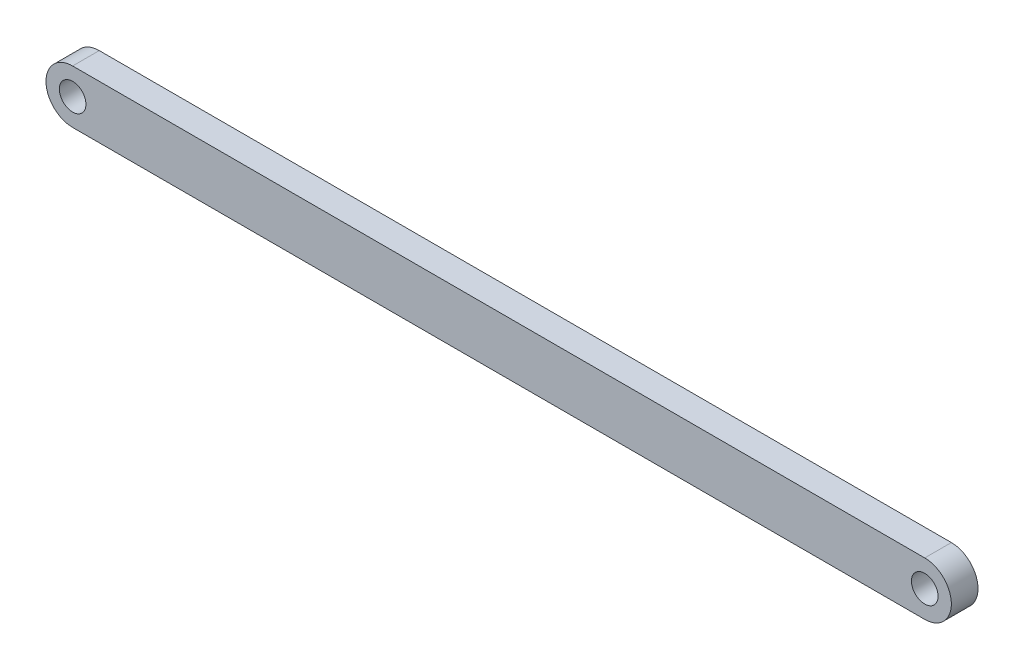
ISO-10303-21;
HEADER;
FILE_DESCRIPTION(('STEP AP214'),'2;1');
FILE_NAME('part.step','',(''),(''),'','','');
FILE_SCHEMA(('AUTOMOTIVE_DESIGN { 1 0 10303 214 1 1 1 1 }'));
ENDSEC;
DATA;
#1=APPLICATION_CONTEXT('core data for automotive mechanical design processes');
#2=APPLICATION_PROTOCOL_DEFINITION('international standard','automotive_design',2000,#1);
#3=PRODUCT_CONTEXT('',#1,'mechanical');
#4=PRODUCT('Part','Part','',(#3));
#5=PRODUCT_RELATED_PRODUCT_CATEGORY('part','',(#4));
#6=PRODUCT_DEFINITION_FORMATION('','',#4);
#7=PRODUCT_DEFINITION_CONTEXT('part definition',#1,'design');
#8=PRODUCT_DEFINITION('design','',#6,#7);
#9=PRODUCT_DEFINITION_SHAPE('','',#8);
#10=(LENGTH_UNIT() NAMED_UNIT(*) SI_UNIT(.MILLI.,.METRE.));
#11=(NAMED_UNIT(*) PLANE_ANGLE_UNIT() SI_UNIT($,.RADIAN.));
#12=(NAMED_UNIT(*) SI_UNIT($,.STERADIAN.) SOLID_ANGLE_UNIT());
#13=UNCERTAINTY_MEASURE_WITH_UNIT(LENGTH_MEASURE(1.E-05),#10,'distance_accuracy_value','');
#14=(GEOMETRIC_REPRESENTATION_CONTEXT(3) GLOBAL_UNCERTAINTY_ASSIGNED_CONTEXT((#13)) GLOBAL_UNIT_ASSIGNED_CONTEXT((#10,
#11,#12)) REPRESENTATION_CONTEXT('',''));
#15=CARTESIAN_POINT('',(0.,0.,0.));
#16=DIRECTION('',(0.,0.,1.));
#17=DIRECTION('',(1.,0.,0.));
#18=AXIS2_PLACEMENT_3D('',#15,#16,#17);
#19=CARTESIAN_POINT('',(0.,0.,3.175));
#20=DIRECTION('',(0.,0.,1.));
#21=DIRECTION('',(1.,0.,0.));
#22=AXIS2_PLACEMENT_3D('',#19,#20,#21);
#23=PLANE('',#22);
#24=CARTESIAN_POINT('',(0.,0.,3.175));
#25=DIRECTION('',(0.,0.,1.));
#26=DIRECTION('',(1.,0.,0.));
#27=AXIS2_PLACEMENT_3D('',#24,#25,#26);
#28=CIRCLE('',#27,1.5875);
#29=CARTESIAN_POINT('',(1.5875,0.,3.175));
#30=VERTEX_POINT('',#29);
#31=EDGE_CURVE('E100',#30,#30,#28,.T.);
#32=ORIENTED_EDGE('',*,*,#31,.F.);
#33=EDGE_LOOP('',(#32));
#34=FACE_BOUND('',#33,.T.);
#35=CARTESIAN_POINT('',(0.,0.,3.175));
#36=DIRECTION('',(0.,0.,1.));
#37=DIRECTION('',(1.,0.,0.));
#38=AXIS2_PLACEMENT_3D('',#35,#36,#37);
#39=CIRCLE('',#38,3.175);
#40=CARTESIAN_POINT('',(0.,3.175,3.175));
#41=VERTEX_POINT('',#40);
#42=CARTESIAN_POINT('',(0.,-3.175,3.175));
#43=VERTEX_POINT('',#42);
#44=EDGE_CURVE('E85',#41,#43,#39,.T.);
#45=ORIENTED_EDGE('',*,*,#44,.T.);
#46=DIRECTION('',(1.,0.,0.));
#47=VECTOR('',#46,1.);
#48=CARTESIAN_POINT('',(0.,-3.175,3.175));
#49=LINE('',#48,#47);
#50=CARTESIAN_POINT('',(101.6,-3.175,3.175));
#51=VERTEX_POINT('',#50);
#52=EDGE_CURVE('E80',#43,#51,#49,.T.);
#53=ORIENTED_EDGE('',*,*,#52,.T.);
#54=CARTESIAN_POINT('',(101.6,0.,3.175));
#55=DIRECTION('',(0.,0.,1.));
#56=DIRECTION('',(1.,0.,0.));
#57=AXIS2_PLACEMENT_3D('',#54,#55,#56);
#58=CIRCLE('',#57,3.175);
#59=CARTESIAN_POINT('',(101.6,3.175,3.175));
#60=VERTEX_POINT('',#59);
#61=EDGE_CURVE('E83',#51,#60,#58,.T.);
#62=ORIENTED_EDGE('',*,*,#61,.T.);
#63=DIRECTION('',(-1.,0.,0.));
#64=VECTOR('',#63,1.);
#65=CARTESIAN_POINT('',(0.,3.175,3.175));
#66=LINE('',#65,#64);
#67=EDGE_CURVE('E50',#60,#41,#66,.T.);
#68=ORIENTED_EDGE('',*,*,#67,.T.);
#69=EDGE_LOOP('',(#45,#53,#62,#68));
#70=FACE_BOUND('',#69,.T.);
#71=CARTESIAN_POINT('',(101.6,0.,3.175));
#72=DIRECTION('',(0.,0.,1.));
#73=DIRECTION('',(1.,0.,0.));
#74=AXIS2_PLACEMENT_3D('',#71,#72,#73);
#75=CIRCLE('',#74,1.58749999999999);
#76=CARTESIAN_POINT('',(103.1875,0.,3.175));
#77=VERTEX_POINT('',#76);
#78=EDGE_CURVE('E115',#77,#77,#75,.T.);
#79=ORIENTED_EDGE('',*,*,#78,.F.);
#80=EDGE_LOOP('',(#79));
#81=FACE_BOUND('',#80,.T.);
#82=ADVANCED_FACE('F33',(#34,#70,#81),#23,.T.);
#83=CARTESIAN_POINT('',(0.,0.,0.));
#84=DIRECTION('',(0.,0.,1.));
#85=DIRECTION('',(1.,0.,0.));
#86=AXIS2_PLACEMENT_3D('',#83,#84,#85);
#87=PLANE('',#86);
#88=CARTESIAN_POINT('',(0.,0.,0.));
#89=DIRECTION('',(0.,0.,1.));
#90=DIRECTION('',(1.,0.,0.));
#91=AXIS2_PLACEMENT_3D('',#88,#89,#90);
#92=CIRCLE('',#91,3.175);
#93=CARTESIAN_POINT('',(0.,3.175,0.));
#94=VERTEX_POINT('',#93);
#95=CARTESIAN_POINT('',(0.,-3.175,0.));
#96=VERTEX_POINT('',#95);
#97=EDGE_CURVE('E97',#94,#96,#92,.T.);
#98=ORIENTED_EDGE('',*,*,#97,.F.);
#99=DIRECTION('',(-1.,0.,0.));
#100=VECTOR('',#99,1.);
#101=CARTESIAN_POINT('',(0.,3.175,0.));
#102=LINE('',#101,#100);
#103=CARTESIAN_POINT('',(101.6,3.175,0.));
#104=VERTEX_POINT('',#103);
#105=EDGE_CURVE('E73',#104,#94,#102,.T.);
#106=ORIENTED_EDGE('',*,*,#105,.F.);
#107=CARTESIAN_POINT('',(101.6,0.,0.));
#108=DIRECTION('',(0.,0.,1.));
#109=DIRECTION('',(1.,0.,0.));
#110=AXIS2_PLACEMENT_3D('',#107,#108,#109);
#111=CIRCLE('',#110,3.175);
#112=CARTESIAN_POINT('',(101.6,-3.175,0.));
#113=VERTEX_POINT('',#112);
#114=EDGE_CURVE('E67',#113,#104,#111,.T.);
#115=ORIENTED_EDGE('',*,*,#114,.F.);
#116=DIRECTION('',(1.,0.,0.));
#117=VECTOR('',#116,1.);
#118=CARTESIAN_POINT('',(0.,-3.175,0.));
#119=LINE('',#118,#117);
#120=EDGE_CURVE('E89',#96,#113,#119,.T.);
#121=ORIENTED_EDGE('',*,*,#120,.F.);
#122=EDGE_LOOP('',(#98,#106,#115,#121));
#123=FACE_BOUND('',#122,.T.);
#124=CARTESIAN_POINT('',(0.,0.,0.));
#125=DIRECTION('',(0.,0.,1.));
#126=DIRECTION('',(1.,0.,0.));
#127=AXIS2_PLACEMENT_3D('',#124,#125,#126);
#128=CIRCLE('',#127,1.5875);
#129=CARTESIAN_POINT('',(1.5875,0.,0.));
#130=VERTEX_POINT('',#129);
#131=EDGE_CURVE('E112',#130,#130,#128,.T.);
#132=ORIENTED_EDGE('',*,*,#131,.T.);
#133=EDGE_LOOP('',(#132));
#134=FACE_BOUND('',#133,.T.);
#135=CARTESIAN_POINT('',(101.6,0.,0.));
#136=DIRECTION('',(0.,0.,1.));
#137=DIRECTION('',(1.,0.,0.));
#138=AXIS2_PLACEMENT_3D('',#135,#136,#137);
#139=CIRCLE('',#138,1.58749999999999);
#140=CARTESIAN_POINT('',(103.1875,0.,0.));
#141=VERTEX_POINT('',#140);
#142=EDGE_CURVE('E118',#141,#141,#139,.T.);
#143=ORIENTED_EDGE('',*,*,#142,.T.);
#144=EDGE_LOOP('',(#143));
#145=FACE_BOUND('',#144,.T.);
#146=ADVANCED_FACE('F108',(#123,#134,#145),#87,.F.);
#147=CARTESIAN_POINT('',(0.,0.,3.175));
#148=DIRECTION('',(0.,0.,-1.));
#149=DIRECTION('',(-1.,0.,0.));
#150=AXIS2_PLACEMENT_3D('',#147,#148,#149);
#151=CYLINDRICAL_SURFACE('',#150,3.175);
#152=ORIENTED_EDGE('',*,*,#97,.T.);
#153=DIRECTION('',(0.,0.,-1.));
#154=VECTOR('',#153,1.);
#155=CARTESIAN_POINT('',(0.,-3.175,3.175));
#156=LINE('',#155,#154);
#157=EDGE_CURVE('E11',#43,#96,#156,.T.);
#158=ORIENTED_EDGE('',*,*,#157,.F.);
#159=ORIENTED_EDGE('',*,*,#44,.F.);
#160=DIRECTION('',(0.,0.,-1.));
#161=VECTOR('',#160,1.);
#162=CARTESIAN_POINT('',(0.,3.175,3.175));
#163=LINE('',#162,#161);
#164=EDGE_CURVE('E93',#41,#94,#163,.T.);
#165=ORIENTED_EDGE('',*,*,#164,.T.);
#166=EDGE_LOOP('',(#152,#158,#159,#165));
#167=FACE_BOUND('',#166,.T.);
#168=ADVANCED_FACE('F35',(#167),#151,.T.);
#169=CARTESIAN_POINT('',(0.,-3.175,3.175));
#170=DIRECTION('',(0.,1.,0.));
#171=DIRECTION('',(0.,0.,1.));
#172=AXIS2_PLACEMENT_3D('',#169,#170,#171);
#173=PLANE('',#172);
#174=ORIENTED_EDGE('',*,*,#120,.T.);
#175=DIRECTION('',(0.,0.,-1.));
#176=VECTOR('',#175,1.);
#177=CARTESIAN_POINT('',(101.6,-3.175,3.175));
#178=LINE('',#177,#176);
#179=EDGE_CURVE('E42',#51,#113,#178,.T.);
#180=ORIENTED_EDGE('',*,*,#179,.F.);
#181=ORIENTED_EDGE('',*,*,#52,.F.);
#182=ORIENTED_EDGE('',*,*,#157,.T.);
#183=EDGE_LOOP('',(#174,#180,#181,#182));
#184=FACE_BOUND('',#183,.T.);
#185=ADVANCED_FACE('F88',(#184),#173,.F.);
#186=CARTESIAN_POINT('',(101.6,0.,3.175));
#187=DIRECTION('',(0.,0.,-1.));
#188=DIRECTION('',(-1.,0.,0.));
#189=AXIS2_PLACEMENT_3D('',#186,#187,#188);
#190=CYLINDRICAL_SURFACE('',#189,3.175);
#191=ORIENTED_EDGE('',*,*,#114,.T.);
#192=DIRECTION('',(0.,0.,-1.));
#193=VECTOR('',#192,1.);
#194=CARTESIAN_POINT('',(101.6,3.175,3.175));
#195=LINE('',#194,#193);
#196=EDGE_CURVE('E90',#60,#104,#195,.T.);
#197=ORIENTED_EDGE('',*,*,#196,.F.);
#198=ORIENTED_EDGE('',*,*,#61,.F.);
#199=ORIENTED_EDGE('',*,*,#179,.T.);
#200=EDGE_LOOP('',(#191,#197,#198,#199));
#201=FACE_BOUND('',#200,.T.);
#202=ADVANCED_FACE('F91',(#201),#190,.T.);
#203=CARTESIAN_POINT('',(0.,3.175,3.175));
#204=DIRECTION('',(0.,-1.,0.));
#205=DIRECTION('',(0.,0.,-1.));
#206=AXIS2_PLACEMENT_3D('',#203,#204,#205);
#207=PLANE('',#206);
#208=ORIENTED_EDGE('',*,*,#105,.T.);
#209=ORIENTED_EDGE('',*,*,#164,.F.);
#210=ORIENTED_EDGE('',*,*,#67,.F.);
#211=ORIENTED_EDGE('',*,*,#196,.T.);
#212=EDGE_LOOP('',(#208,#209,#210,#211));
#213=FACE_BOUND('',#212,.T.);
#214=ADVANCED_FACE('F105',(#213),#207,.F.);
#215=CARTESIAN_POINT('',(0.,0.,3.175));
#216=DIRECTION('',(0.,0.,-1.));
#217=DIRECTION('',(-1.,0.,0.));
#218=AXIS2_PLACEMENT_3D('',#215,#216,#217);
#219=CYLINDRICAL_SURFACE('',#218,1.5875);
#220=ORIENTED_EDGE('',*,*,#31,.T.);
#221=EDGE_LOOP('',(#220));
#222=FACE_BOUND('',#221,.T.);
#223=ORIENTED_EDGE('',*,*,#131,.F.);
#224=EDGE_LOOP('',(#223));
#225=FACE_BOUND('',#224,.T.);
#226=ADVANCED_FACE('F135',(#222,#225),#219,.F.);
#227=CARTESIAN_POINT('',(101.6,0.,3.175));
#228=DIRECTION('',(0.,0.,-1.));
#229=DIRECTION('',(-1.,0.,0.));
#230=AXIS2_PLACEMENT_3D('',#227,#228,#229);
#231=CYLINDRICAL_SURFACE('',#230,1.58749999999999);
#232=ORIENTED_EDGE('',*,*,#78,.T.);
#233=EDGE_LOOP('',(#232));
#234=FACE_BOUND('',#233,.T.);
#235=ORIENTED_EDGE('',*,*,#142,.F.);
#236=EDGE_LOOP('',(#235));
#237=FACE_BOUND('',#236,.T.);
#238=ADVANCED_FACE('F124',(#234,#237),#231,.F.);
#239=CLOSED_SHELL('',(#82,#146,#168,#185,#202,#214,#226,#238));
#240=MANIFOLD_SOLID_BREP('B2',#239);
#241=ADVANCED_BREP_SHAPE_REPRESENTATION('',(#18,#240),#14);
#242=SHAPE_DEFINITION_REPRESENTATION(#9,#241);
ENDSEC;
END-ISO-10303-21;
